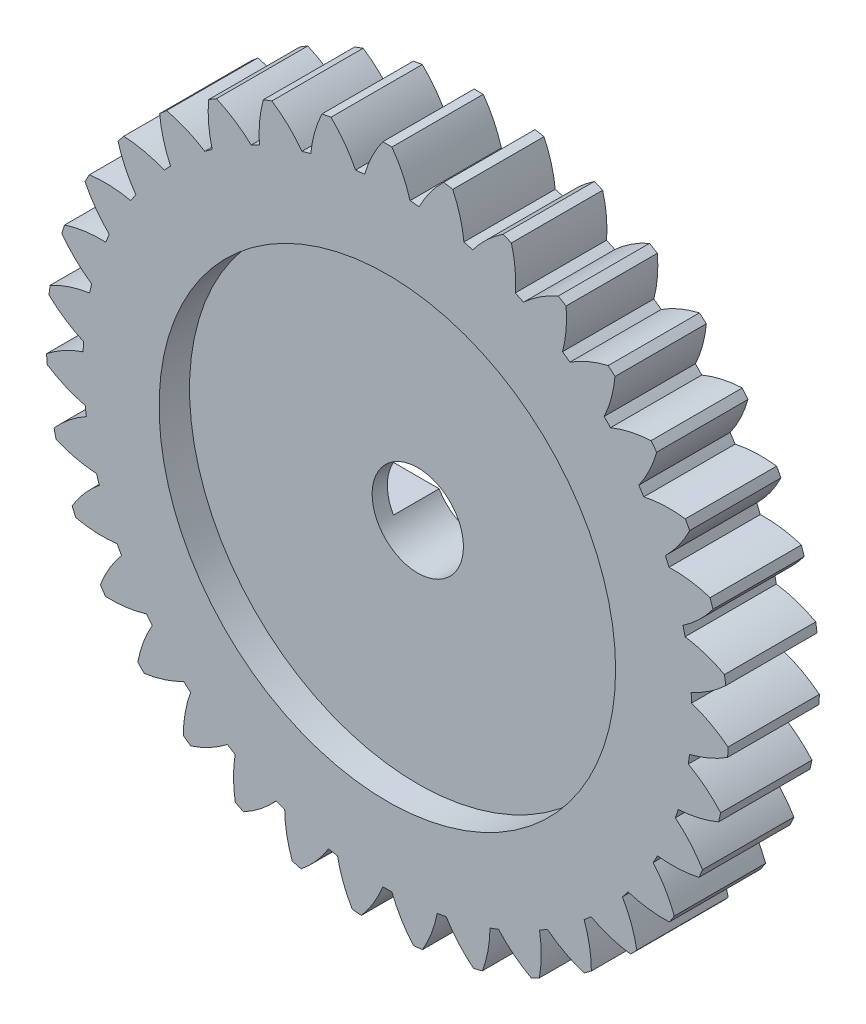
from build123d import *

# Parameters (mm, degrees)
ESQUISSE1_R                  = 11.2
BASE_EXTRUSION_DEPTH         = 3
ENL_V_MAT_EXTRU_2_DEPTH      = 17.120794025
R_P_TITION_CIRCULAIRE2_COUNT = 35
ESQUISSE5_R                  = 7.5
ENL_V_MAT_EXTRU_3_DEPTH      = 1
ENL_V_MAT_EXTRU_4_DEPTH      = 1.5
ESQUISSE7_R                  = 1.5
ENL_V_MAT_EXTRU_5_DEPTH      = 16.906152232


with BuildPart() as part:
    # Esquisse1 → Base-Extrusion (new body)
    with BuildSketch(Plane.XY):
        Circle(ESQUISSE1_R)
    extrude(amount=BASE_EXTRUSION_DEPTH)

    # Esquisse4 → Enl_v. mat.-Extru.2 (cut, through all)
    with BuildSketch(Plane.XY.offset(3)):
        with BuildLine():
            Line((0.896393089, 9.95974294), (1.238090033, 13.756306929))
            Line((1.238090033, 13.756306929), (-1.238090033, 13.756306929))
            Line((-1.238090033, 13.756306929), (-0.896393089, 9.95974294))
            ThreePointArc((-0.896393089, 9.95974294), (-0.821667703, 9.96618594), (-0.746896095, 9.972068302))
            ThreePointArc((-0.746896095, 9.972068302), (-0.501147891, 10.611170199), (-0.15, 11.198995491))
            ThreePointArc((-0.15, 11.198995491), (0, 11.2), (0.15, 11.198995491))
            ThreePointArc((0.15, 11.198995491), (0.501147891, 10.611170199), (0.746896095, 9.972068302))
            ThreePointArc((0.746896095, 9.972068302), (0.821667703, 9.96618594), (0.896393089, 9.95974294))
        make_face()
    enl_v_mat_extru_2 = extrude(amount=-ENL_V_MAT_EXTRU_2_DEPTH, mode=Mode.SUBTRACT)

    # R_p_tition circulaire2: Enl_v. mat.-Extru.2 ×35 about axis
    r_p_tition_circulaire2_axis = Axis((0, 0, 0), (0, 0, 1))
    for i in range(1, R_P_TITION_CIRCULAIRE2_COUNT):
        add(enl_v_mat_extru_2.rotate(r_p_tition_circulaire2_axis, i * 360 / R_P_TITION_CIRCULAIRE2_COUNT), mode=Mode.SUBTRACT)

    # Esquisse5 → Enl_v. mat.-Extru.3 (cut)
    with BuildSketch(Plane.XY.offset(3)):
        Circle(ESQUISSE5_R)
    extrude(amount=-ENL_V_MAT_EXTRU_3_DEPTH, mode=Mode.SUBTRACT)

    # Esquisse6 → Enl_v. mat.-Extru.4 (cut)
    with BuildSketch(Plane(origin=(0, 0, 0), x_dir=(-1, 0, 0), z_dir=(0, 0, -1))):
        with BuildLine():
            Line((1.299038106, 0.75), (5, 0.75))
            Line((5, 0.75), (5, -0.75))
            Line((5, -0.75), (1.299038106, -0.75))
            ThreePointArc((1.299038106, -0.75), (0, -1.5), (-1.299038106, -0.75))
            Line((-1.299038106, -0.75), (-5, -0.75))
            Line((-5, -0.75), (-5, 0.75))
            Line((-5, 0.75), (-1.299038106, 0.75))
            ThreePointArc((-1.299038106, 0.75), (0, 1.5), (1.299038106, 0.75))
        make_face()
    extrude(amount=-ENL_V_MAT_EXTRU_4_DEPTH, mode=Mode.SUBTRACT)

    # Esquisse7 → Enl_v. mat.-Extru.5 (cut, through all)
    with BuildSketch(Plane(origin=(0, 0, 1.5), x_dir=(-1, 0, 0), z_dir=(0, 0, -1))):
        with Locations(Location((0, 0, 0), (0, 0, 30))):
            Circle(ESQUISSE7_R)
    extrude(amount=-ENL_V_MAT_EXTRU_5_DEPTH, mode=Mode.SUBTRACT)


solid = part.part
